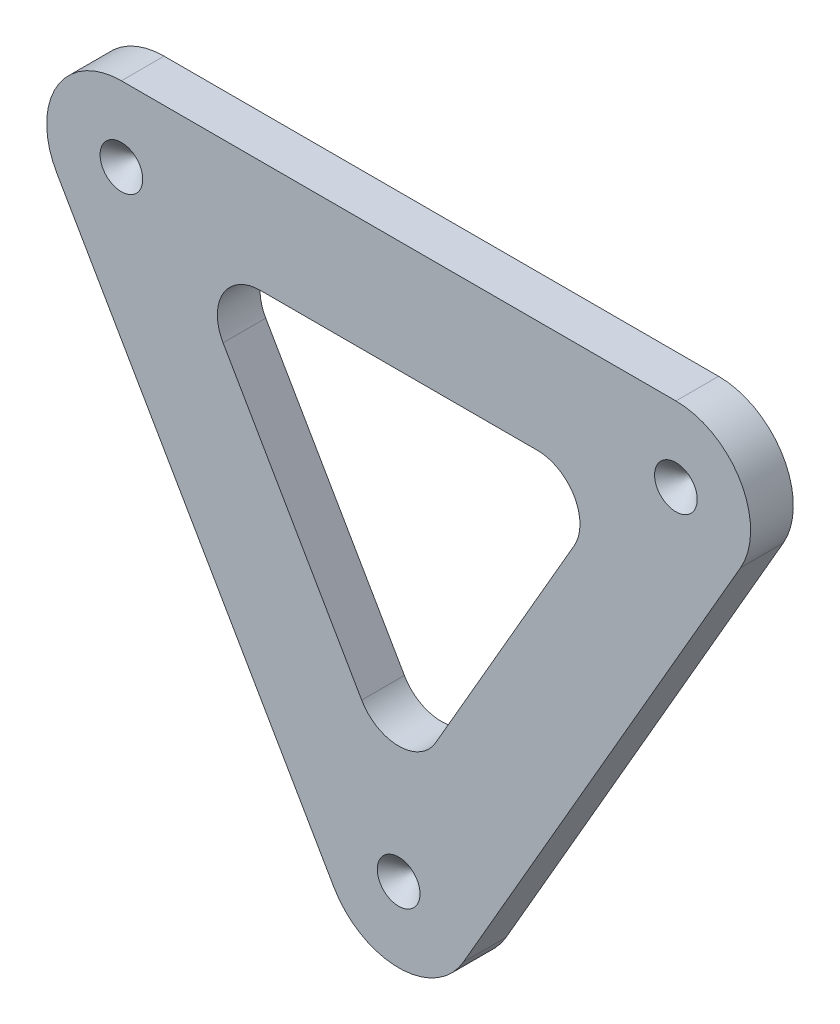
ISO-10303-21;
HEADER;
FILE_DESCRIPTION(('STEP AP214'),'2;1');
FILE_NAME('part.step','',(''),(''),'','','');
FILE_SCHEMA(('AUTOMOTIVE_DESIGN { 1 0 10303 214 1 1 1 1 }'));
ENDSEC;
DATA;
#1=APPLICATION_CONTEXT('core data for automotive mechanical design processes');
#2=APPLICATION_PROTOCOL_DEFINITION('international standard','automotive_design',2000,#1);
#3=PRODUCT_CONTEXT('',#1,'mechanical');
#4=PRODUCT('Part','Part','',(#3));
#5=PRODUCT_RELATED_PRODUCT_CATEGORY('part','',(#4));
#6=PRODUCT_DEFINITION_FORMATION('','',#4);
#7=PRODUCT_DEFINITION_CONTEXT('part definition',#1,'design');
#8=PRODUCT_DEFINITION('design','',#6,#7);
#9=PRODUCT_DEFINITION_SHAPE('','',#8);
#10=(LENGTH_UNIT() NAMED_UNIT(*) SI_UNIT(.MILLI.,.METRE.));
#11=(NAMED_UNIT(*) PLANE_ANGLE_UNIT() SI_UNIT($,.RADIAN.));
#12=(NAMED_UNIT(*) SI_UNIT($,.STERADIAN.) SOLID_ANGLE_UNIT());
#13=UNCERTAINTY_MEASURE_WITH_UNIT(LENGTH_MEASURE(1.E-05),#10,'distance_accuracy_value','');
#14=(GEOMETRIC_REPRESENTATION_CONTEXT(3) GLOBAL_UNCERTAINTY_ASSIGNED_CONTEXT((#13)) GLOBAL_UNIT_ASSIGNED_CONTEXT((#10,
#11,#12)) REPRESENTATION_CONTEXT('',''));
#15=CARTESIAN_POINT('',(0.,0.,0.));
#16=DIRECTION('',(0.,0.,1.));
#17=DIRECTION('',(1.,0.,0.));
#18=AXIS2_PLACEMENT_3D('',#15,#16,#17);
#19=CARTESIAN_POINT('',(12.9903810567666,7.5,2.));
#20=DIRECTION('',(0.,0.,1.));
#21=DIRECTION('',(1.,0.,0.));
#22=AXIS2_PLACEMENT_3D('',#19,#20,#21);
#23=PLANE('',#22);
#24=CARTESIAN_POINT('',(-12.9903810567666,7.49999999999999,2.));
#25=DIRECTION('',(0.,0.,1.));
#26=DIRECTION('',(1.,0.,0.));
#27=AXIS2_PLACEMENT_3D('',#24,#25,#26);
#28=CIRCLE('',#27,1.);
#29=CARTESIAN_POINT('',(-11.9903810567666,7.49999999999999,2.));
#30=VERTEX_POINT('',#29);
#31=EDGE_CURVE('E138',#30,#30,#28,.T.);
#32=ORIENTED_EDGE('',*,*,#31,.F.);
#33=EDGE_LOOP('',(#32));
#34=FACE_BOUND('',#33,.T.);
#35=CARTESIAN_POINT('',(0.,-15.,2.));
#36=DIRECTION('',(0.,0.,1.));
#37=DIRECTION('',(1.,0.,0.));
#38=AXIS2_PLACEMENT_3D('',#35,#36,#37);
#39=CIRCLE('',#38,1.);
#40=CARTESIAN_POINT('',(1.00000000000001,-15.,2.));
#41=VERTEX_POINT('',#40);
#42=EDGE_CURVE('E140',#41,#41,#39,.T.);
#43=ORIENTED_EDGE('',*,*,#42,.F.);
#44=EDGE_LOOP('',(#43));
#45=FACE_BOUND('',#44,.T.);
#46=CARTESIAN_POINT('',(12.9903810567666,7.5,2.));
#47=DIRECTION('',(0.,0.,1.));
#48=DIRECTION('',(1.,0.,0.));
#49=AXIS2_PLACEMENT_3D('',#46,#47,#48);
#50=CIRCLE('',#49,1.);
#51=CARTESIAN_POINT('',(13.9903810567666,7.5,2.));
#52=VERTEX_POINT('',#51);
#53=EDGE_CURVE('E143',#52,#52,#50,.T.);
#54=ORIENTED_EDGE('',*,*,#53,.F.);
#55=EDGE_LOOP('',(#54));
#56=FACE_BOUND('',#55,.T.);
#57=CARTESIAN_POINT('',(12.9903810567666,7.5,2.));
#58=DIRECTION('',(0.,0.,1.));
#59=DIRECTION('',(1.,0.,0.));
#60=AXIS2_PLACEMENT_3D('',#57,#58,#59);
#61=CIRCLE('',#60,3.50000000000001);
#62=CARTESIAN_POINT('',(16.0214699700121,5.75,2.));
#63=VERTEX_POINT('',#62);
#64=CARTESIAN_POINT('',(12.9903810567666,11.,2.));
#65=VERTEX_POINT('',#64);
#66=EDGE_CURVE('E166',#63,#65,#61,.T.);
#67=ORIENTED_EDGE('',*,*,#66,.T.);
#68=DIRECTION('',(-1.,0.,0.));
#69=VECTOR('',#68,1.);
#70=CARTESIAN_POINT('',(12.9903810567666,11.,2.));
#71=LINE('',#70,#69);
#72=CARTESIAN_POINT('',(-12.9903810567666,11.,2.));
#73=VERTEX_POINT('',#72);
#74=EDGE_CURVE('E169',#65,#73,#71,.T.);
#75=ORIENTED_EDGE('',*,*,#74,.T.);
#76=CARTESIAN_POINT('',(-12.9903810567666,7.49999999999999,2.));
#77=DIRECTION('',(0.,0.,1.));
#78=DIRECTION('',(1.,0.,0.));
#79=AXIS2_PLACEMENT_3D('',#76,#77,#78);
#80=CIRCLE('',#79,3.49999999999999);
#81=CARTESIAN_POINT('',(-16.0214699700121,5.74999999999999,2.));
#82=VERTEX_POINT('',#81);
#83=EDGE_CURVE('E172',#73,#82,#80,.T.);
#84=ORIENTED_EDGE('',*,*,#83,.T.);
#85=DIRECTION('',(0.5,-0.866025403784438,0.));
#86=VECTOR('',#85,1.);
#87=CARTESIAN_POINT('',(-16.0214699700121,5.74999999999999,2.));
#88=LINE('',#87,#86);
#89=CARTESIAN_POINT('',(-3.03108891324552,-16.75,2.));
#90=VERTEX_POINT('',#89);
#91=EDGE_CURVE('E174',#82,#90,#88,.T.);
#92=ORIENTED_EDGE('',*,*,#91,.T.);
#93=CARTESIAN_POINT('',(0.,-15.,2.));
#94=DIRECTION('',(0.,0.,1.));
#95=DIRECTION('',(1.,0.,0.));
#96=AXIS2_PLACEMENT_3D('',#93,#94,#95);
#97=CIRCLE('',#96,3.49999999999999);
#98=CARTESIAN_POINT('',(3.03108891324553,-16.75,2.));
#99=VERTEX_POINT('',#98);
#100=EDGE_CURVE('E176',#90,#99,#97,.T.);
#101=ORIENTED_EDGE('',*,*,#100,.T.);
#102=DIRECTION('',(0.5,0.866025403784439,0.));
#103=VECTOR('',#102,1.);
#104=CARTESIAN_POINT('',(3.03108891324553,-16.75,2.));
#105=LINE('',#104,#103);
#106=EDGE_CURVE('E178',#99,#63,#105,.T.);
#107=ORIENTED_EDGE('',*,*,#106,.T.);
#108=EDGE_LOOP('',(#67,#75,#84,#92,#101,#107));
#109=FACE_BOUND('',#108,.T.);
#110=DIRECTION('',(-1.,0.,0.));
#111=VECTOR('',#110,1.);
#112=CARTESIAN_POINT('',(9.95929214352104,5.75,2.));
#113=LINE('',#112,#111);
#114=CARTESIAN_POINT('',(6.49519052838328,5.75,2.));
#115=VERTEX_POINT('',#114);
#116=CARTESIAN_POINT('',(-6.49519052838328,5.75,2.));
#117=VERTEX_POINT('',#116);
#118=EDGE_CURVE('E151',#115,#117,#113,.T.);
#119=ORIENTED_EDGE('',*,*,#118,.F.);
#120=CARTESIAN_POINT('',(6.49519052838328,3.75,2.));
#121=DIRECTION('',(0.,0.,1.));
#122=DIRECTION('',(1.,0.,0.));
#123=AXIS2_PLACEMENT_3D('',#120,#121,#122);
#124=CIRCLE('',#123,2.);
#125=CARTESIAN_POINT('',(8.22724133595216,2.75,2.));
#126=VERTEX_POINT('',#125);
#127=EDGE_CURVE('E11',#115,#126,#124,.F.);
#128=ORIENTED_EDGE('',*,*,#127,.T.);
#129=DIRECTION('',(0.5,0.866025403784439,0.));
#130=VECTOR('',#129,1.);
#131=CARTESIAN_POINT('',(0.,-11.5,2.));
#132=LINE('',#131,#130);
#133=CARTESIAN_POINT('',(1.73205080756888,-8.49999999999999,2.));
#134=VERTEX_POINT('',#133);
#135=EDGE_CURVE('E149',#134,#126,#132,.T.);
#136=ORIENTED_EDGE('',*,*,#135,.F.);
#137=CARTESIAN_POINT('',(0.,-7.49999999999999,2.));
#138=DIRECTION('',(0.,0.,1.));
#139=DIRECTION('',(1.,0.,0.));
#140=AXIS2_PLACEMENT_3D('',#137,#138,#139);
#141=CIRCLE('',#140,2.);
#142=CARTESIAN_POINT('',(-1.73205080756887,-8.49999999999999,2.));
#143=VERTEX_POINT('',#142);
#144=EDGE_CURVE('E229',#134,#143,#141,.F.);
#145=ORIENTED_EDGE('',*,*,#144,.T.);
#146=DIRECTION('',(0.5,-0.866025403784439,0.));
#147=VECTOR('',#146,1.);
#148=CARTESIAN_POINT('',(-9.95929214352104,5.75,2.));
#149=LINE('',#148,#147);
#150=CARTESIAN_POINT('',(-8.22724133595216,2.75,2.));
#151=VERTEX_POINT('',#150);
#152=EDGE_CURVE('E155',#151,#143,#149,.T.);
#153=ORIENTED_EDGE('',*,*,#152,.F.);
#154=CARTESIAN_POINT('',(-6.49519052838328,3.75,2.));
#155=DIRECTION('',(0.,0.,1.));
#156=DIRECTION('',(1.,0.,0.));
#157=AXIS2_PLACEMENT_3D('',#154,#155,#156);
#158=CIRCLE('',#157,2.);
#159=EDGE_CURVE('E225',#151,#117,#158,.F.);
#160=ORIENTED_EDGE('',*,*,#159,.T.);
#161=EDGE_LOOP('',(#119,#128,#136,#145,#153,#160));
#162=FACE_BOUND('',#161,.T.);
#163=ADVANCED_FACE('F35',(#34,#45,#56,#109,#162),#23,.T.);
#164=CARTESIAN_POINT('',(12.9903810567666,7.5,0.));
#165=DIRECTION('',(0.,0.,1.));
#166=DIRECTION('',(1.,0.,0.));
#167=AXIS2_PLACEMENT_3D('',#164,#165,#166);
#168=PLANE('',#167);
#169=CARTESIAN_POINT('',(12.9903810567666,7.5,0.));
#170=DIRECTION('',(0.,0.,1.));
#171=DIRECTION('',(1.,0.,0.));
#172=AXIS2_PLACEMENT_3D('',#169,#170,#171);
#173=CIRCLE('',#172,3.50000000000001);
#174=CARTESIAN_POINT('',(16.0214699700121,5.75,0.));
#175=VERTEX_POINT('',#174);
#176=CARTESIAN_POINT('',(12.9903810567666,11.,0.));
#177=VERTEX_POINT('',#176);
#178=EDGE_CURVE('E158',#175,#177,#173,.T.);
#179=ORIENTED_EDGE('',*,*,#178,.F.);
#180=DIRECTION('',(0.5,0.866025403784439,0.));
#181=VECTOR('',#180,1.);
#182=CARTESIAN_POINT('',(3.03108891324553,-16.75,0.));
#183=LINE('',#182,#181);
#184=CARTESIAN_POINT('',(3.03108891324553,-16.75,0.));
#185=VERTEX_POINT('',#184);
#186=EDGE_CURVE('E170',#185,#175,#183,.T.);
#187=ORIENTED_EDGE('',*,*,#186,.F.);
#188=CARTESIAN_POINT('',(0.,-15.,0.));
#189=DIRECTION('',(0.,0.,1.));
#190=DIRECTION('',(1.,0.,0.));
#191=AXIS2_PLACEMENT_3D('',#188,#189,#190);
#192=CIRCLE('',#191,3.49999999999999);
#193=CARTESIAN_POINT('',(-3.03108891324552,-16.75,0.));
#194=VERTEX_POINT('',#193);
#195=EDGE_CURVE('E189',#194,#185,#192,.T.);
#196=ORIENTED_EDGE('',*,*,#195,.F.);
#197=DIRECTION('',(0.5,-0.866025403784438,0.));
#198=VECTOR('',#197,1.);
#199=CARTESIAN_POINT('',(-16.0214699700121,5.74999999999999,0.));
#200=LINE('',#199,#198);
#201=CARTESIAN_POINT('',(-16.0214699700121,5.74999999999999,0.));
#202=VERTEX_POINT('',#201);
#203=EDGE_CURVE('E187',#202,#194,#200,.T.);
#204=ORIENTED_EDGE('',*,*,#203,.F.);
#205=CARTESIAN_POINT('',(-12.9903810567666,7.49999999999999,0.));
#206=DIRECTION('',(0.,0.,1.));
#207=DIRECTION('',(1.,0.,0.));
#208=AXIS2_PLACEMENT_3D('',#205,#206,#207);
#209=CIRCLE('',#208,3.49999999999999);
#210=CARTESIAN_POINT('',(-12.9903810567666,11.,0.));
#211=VERTEX_POINT('',#210);
#212=EDGE_CURVE('E185',#211,#202,#209,.T.);
#213=ORIENTED_EDGE('',*,*,#212,.F.);
#214=DIRECTION('',(-1.,0.,0.));
#215=VECTOR('',#214,1.);
#216=CARTESIAN_POINT('',(12.9903810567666,11.,0.));
#217=LINE('',#216,#215);
#218=EDGE_CURVE('E183',#177,#211,#217,.T.);
#219=ORIENTED_EDGE('',*,*,#218,.F.);
#220=EDGE_LOOP('',(#179,#187,#196,#204,#213,#219));
#221=FACE_BOUND('',#220,.T.);
#222=DIRECTION('',(0.5,-0.866025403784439,0.));
#223=VECTOR('',#222,1.);
#224=CARTESIAN_POINT('',(-9.95929214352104,5.75,0.));
#225=LINE('',#224,#223);
#226=CARTESIAN_POINT('',(-8.22724133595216,2.75,0.));
#227=VERTEX_POINT('',#226);
#228=CARTESIAN_POINT('',(-1.73205080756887,-8.49999999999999,0.));
#229=VERTEX_POINT('',#228);
#230=EDGE_CURVE('E152',#227,#229,#225,.T.);
#231=ORIENTED_EDGE('',*,*,#230,.T.);
#232=CARTESIAN_POINT('',(0.,-7.49999999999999,0.));
#233=DIRECTION('',(0.,0.,1.));
#234=DIRECTION('',(1.,0.,0.));
#235=AXIS2_PLACEMENT_3D('',#232,#233,#234);
#236=CIRCLE('',#235,2.);
#237=CARTESIAN_POINT('',(1.73205080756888,-8.49999999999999,0.));
#238=VERTEX_POINT('',#237);
#239=EDGE_CURVE('E227',#229,#238,#236,.T.);
#240=ORIENTED_EDGE('',*,*,#239,.T.);
#241=DIRECTION('',(0.5,0.866025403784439,0.));
#242=VECTOR('',#241,1.);
#243=CARTESIAN_POINT('',(0.,-11.5,0.));
#244=LINE('',#243,#242);
#245=CARTESIAN_POINT('',(8.22724133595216,2.75,0.));
#246=VERTEX_POINT('',#245);
#247=EDGE_CURVE('E148',#238,#246,#244,.T.);
#248=ORIENTED_EDGE('',*,*,#247,.T.);
#249=CARTESIAN_POINT('',(6.49519052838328,3.75,0.));
#250=DIRECTION('',(0.,0.,1.));
#251=DIRECTION('',(1.,0.,0.));
#252=AXIS2_PLACEMENT_3D('',#249,#250,#251);
#253=CIRCLE('',#252,2.);
#254=CARTESIAN_POINT('',(6.49519052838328,5.75,0.));
#255=VERTEX_POINT('',#254);
#256=EDGE_CURVE('E43',#246,#255,#253,.T.);
#257=ORIENTED_EDGE('',*,*,#256,.T.);
#258=DIRECTION('',(-1.,0.,0.));
#259=VECTOR('',#258,1.);
#260=CARTESIAN_POINT('',(9.95929214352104,5.75,0.));
#261=LINE('',#260,#259);
#262=CARTESIAN_POINT('',(-6.49519052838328,5.75,0.));
#263=VERTEX_POINT('',#262);
#264=EDGE_CURVE('E161',#255,#263,#261,.T.);
#265=ORIENTED_EDGE('',*,*,#264,.T.);
#266=CARTESIAN_POINT('',(-6.49519052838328,3.75,0.));
#267=DIRECTION('',(0.,0.,1.));
#268=DIRECTION('',(1.,0.,0.));
#269=AXIS2_PLACEMENT_3D('',#266,#267,#268);
#270=CIRCLE('',#269,2.);
#271=EDGE_CURVE('E223',#263,#227,#270,.T.);
#272=ORIENTED_EDGE('',*,*,#271,.T.);
#273=EDGE_LOOP('',(#231,#240,#248,#257,#265,#272));
#274=FACE_BOUND('',#273,.T.);
#275=ADVANCED_FACE('F232',(#221,#274),#168,.F.);
#276=CARTESIAN_POINT('',(12.9903810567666,7.5,2.));
#277=DIRECTION('',(0.,0.,-1.));
#278=DIRECTION('',(-1.,0.,0.));
#279=AXIS2_PLACEMENT_3D('',#276,#277,#278);
#280=CYLINDRICAL_SURFACE('',#279,3.50000000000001);
#281=ORIENTED_EDGE('',*,*,#178,.T.);
#282=DIRECTION('',(0.,0.,-1.));
#283=VECTOR('',#282,1.);
#284=CARTESIAN_POINT('',(12.9903810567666,11.,2.));
#285=LINE('',#284,#283);
#286=EDGE_CURVE('E206',#65,#177,#285,.T.);
#287=ORIENTED_EDGE('',*,*,#286,.F.);
#288=ORIENTED_EDGE('',*,*,#66,.F.);
#289=DIRECTION('',(0.,0.,-1.));
#290=VECTOR('',#289,1.);
#291=CARTESIAN_POINT('',(16.0214699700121,5.75,2.));
#292=LINE('',#291,#290);
#293=EDGE_CURVE('E180',#63,#175,#292,.T.);
#294=ORIENTED_EDGE('',*,*,#293,.T.);
#295=EDGE_LOOP('',(#281,#287,#288,#294));
#296=FACE_BOUND('',#295,.T.);
#297=ADVANCED_FACE('F265',(#296),#280,.T.);
#298=CARTESIAN_POINT('',(12.9903810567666,11.,2.));
#299=DIRECTION('',(0.,-1.,0.));
#300=DIRECTION('',(1.,0.,0.));
#301=AXIS2_PLACEMENT_3D('',#298,#299,#300);
#302=PLANE('',#301);
#303=ORIENTED_EDGE('',*,*,#218,.T.);
#304=DIRECTION('',(0.,0.,-1.));
#305=VECTOR('',#304,1.);
#306=CARTESIAN_POINT('',(-12.9903810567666,11.,2.));
#307=LINE('',#306,#305);
#308=EDGE_CURVE('E203',#73,#211,#307,.T.);
#309=ORIENTED_EDGE('',*,*,#308,.F.);
#310=ORIENTED_EDGE('',*,*,#74,.F.);
#311=ORIENTED_EDGE('',*,*,#286,.T.);
#312=EDGE_LOOP('',(#303,#309,#310,#311));
#313=FACE_BOUND('',#312,.T.);
#314=ADVANCED_FACE('F287',(#313),#302,.F.);
#315=CARTESIAN_POINT('',(-12.9903810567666,7.49999999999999,2.));
#316=DIRECTION('',(0.,0.,-1.));
#317=DIRECTION('',(-1.,0.,0.));
#318=AXIS2_PLACEMENT_3D('',#315,#316,#317);
#319=CYLINDRICAL_SURFACE('',#318,3.49999999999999);
#320=ORIENTED_EDGE('',*,*,#212,.T.);
#321=DIRECTION('',(0.,0.,-1.));
#322=VECTOR('',#321,1.);
#323=CARTESIAN_POINT('',(-16.0214699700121,5.74999999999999,2.));
#324=LINE('',#323,#322);
#325=EDGE_CURVE('E200',#82,#202,#324,.T.);
#326=ORIENTED_EDGE('',*,*,#325,.F.);
#327=ORIENTED_EDGE('',*,*,#83,.F.);
#328=ORIENTED_EDGE('',*,*,#308,.T.);
#329=EDGE_LOOP('',(#320,#326,#327,#328));
#330=FACE_BOUND('',#329,.T.);
#331=ADVANCED_FACE('F283',(#330),#319,.T.);
#332=CARTESIAN_POINT('',(-16.0214699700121,5.74999999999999,2.));
#333=DIRECTION('',(0.866025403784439,0.5,0.));
#334=DIRECTION('',(-0.5,0.866025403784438,0.));
#335=AXIS2_PLACEMENT_3D('',#332,#333,#334);
#336=PLANE('',#335);
#337=ORIENTED_EDGE('',*,*,#203,.T.);
#338=DIRECTION('',(0.,0.,-1.));
#339=VECTOR('',#338,1.);
#340=CARTESIAN_POINT('',(-3.03108891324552,-16.75,2.));
#341=LINE('',#340,#339);
#342=EDGE_CURVE('E197',#90,#194,#341,.T.);
#343=ORIENTED_EDGE('',*,*,#342,.F.);
#344=ORIENTED_EDGE('',*,*,#91,.F.);
#345=ORIENTED_EDGE('',*,*,#325,.T.);
#346=EDGE_LOOP('',(#337,#343,#344,#345));
#347=FACE_BOUND('',#346,.T.);
#348=ADVANCED_FACE('F279',(#347),#336,.F.);
#349=CARTESIAN_POINT('',(0.,-15.,2.));
#350=DIRECTION('',(0.,0.,-1.));
#351=DIRECTION('',(-1.,0.,0.));
#352=AXIS2_PLACEMENT_3D('',#349,#350,#351);
#353=CYLINDRICAL_SURFACE('',#352,3.49999999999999);
#354=ORIENTED_EDGE('',*,*,#195,.T.);
#355=DIRECTION('',(0.,0.,-1.));
#356=VECTOR('',#355,1.);
#357=CARTESIAN_POINT('',(3.03108891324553,-16.75,2.));
#358=LINE('',#357,#356);
#359=EDGE_CURVE('E194',#99,#185,#358,.T.);
#360=ORIENTED_EDGE('',*,*,#359,.F.);
#361=ORIENTED_EDGE('',*,*,#100,.F.);
#362=ORIENTED_EDGE('',*,*,#342,.T.);
#363=EDGE_LOOP('',(#354,#360,#361,#362));
#364=FACE_BOUND('',#363,.T.);
#365=ADVANCED_FACE('F275',(#364),#353,.T.);
#366=CARTESIAN_POINT('',(3.03108891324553,-16.75,2.));
#367=DIRECTION('',(-0.866025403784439,0.5,0.));
#368=DIRECTION('',(-0.5,-0.866025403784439,0.));
#369=AXIS2_PLACEMENT_3D('',#366,#367,#368);
#370=PLANE('',#369);
#371=ORIENTED_EDGE('',*,*,#186,.T.);
#372=ORIENTED_EDGE('',*,*,#293,.F.);
#373=ORIENTED_EDGE('',*,*,#106,.F.);
#374=ORIENTED_EDGE('',*,*,#359,.T.);
#375=EDGE_LOOP('',(#371,#372,#373,#374));
#376=FACE_BOUND('',#375,.T.);
#377=ADVANCED_FACE('F272',(#376),#370,.F.);
#378=CARTESIAN_POINT('',(0.,-11.5,2.));
#379=DIRECTION('',(-0.866025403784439,0.5,0.));
#380=DIRECTION('',(-0.5,-0.866025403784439,0.));
#381=AXIS2_PLACEMENT_3D('',#378,#379,#380);
#382=PLANE('',#381);
#383=ORIENTED_EDGE('',*,*,#247,.F.);
#384=DIRECTION('',(0.,0.,-1.));
#385=VECTOR('',#384,1.);
#386=CARTESIAN_POINT('',(1.73205080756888,-8.49999999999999,2.));
#387=LINE('',#386,#385);
#388=EDGE_CURVE('E55',#238,#134,#387,.F.);
#389=ORIENTED_EDGE('',*,*,#388,.T.);
#390=ORIENTED_EDGE('',*,*,#135,.T.);
#391=DIRECTION('',(0.,0.,-1.));
#392=VECTOR('',#391,1.);
#393=CARTESIAN_POINT('',(8.22724133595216,2.75,0.));
#394=LINE('',#393,#392);
#395=EDGE_CURVE('E219',#126,#246,#394,.T.);
#396=ORIENTED_EDGE('',*,*,#395,.T.);
#397=EDGE_LOOP('',(#383,#389,#390,#396));
#398=FACE_BOUND('',#397,.T.);
#399=ADVANCED_FACE('F239',(#398),#382,.T.);
#400=CARTESIAN_POINT('',(9.95929214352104,5.75,2.));
#401=DIRECTION('',(0.,-1.,0.));
#402=DIRECTION('',(1.,0.,0.));
#403=AXIS2_PLACEMENT_3D('',#400,#401,#402);
#404=PLANE('',#403);
#405=ORIENTED_EDGE('',*,*,#118,.T.);
#406=DIRECTION('',(0.,0.,-1.));
#407=VECTOR('',#406,1.);
#408=CARTESIAN_POINT('',(-6.49519052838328,5.75,0.));
#409=LINE('',#408,#407);
#410=EDGE_CURVE('E211',#117,#263,#409,.T.);
#411=ORIENTED_EDGE('',*,*,#410,.T.);
#412=ORIENTED_EDGE('',*,*,#264,.F.);
#413=DIRECTION('',(0.,0.,-1.));
#414=VECTOR('',#413,1.);
#415=CARTESIAN_POINT('',(6.49519052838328,5.75,2.));
#416=LINE('',#415,#414);
#417=EDGE_CURVE('E209',#255,#115,#416,.F.);
#418=ORIENTED_EDGE('',*,*,#417,.T.);
#419=EDGE_LOOP('',(#405,#411,#412,#418));
#420=FACE_BOUND('',#419,.T.);
#421=ADVANCED_FACE('F237',(#420),#404,.T.);
#422=CARTESIAN_POINT('',(-9.95929214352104,5.75,2.));
#423=DIRECTION('',(0.866025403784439,0.5,0.));
#424=DIRECTION('',(-0.5,0.866025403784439,0.));
#425=AXIS2_PLACEMENT_3D('',#422,#423,#424);
#426=PLANE('',#425);
#427=ORIENTED_EDGE('',*,*,#230,.F.);
#428=DIRECTION('',(0.,0.,-1.));
#429=VECTOR('',#428,1.);
#430=CARTESIAN_POINT('',(-8.22724133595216,2.75,2.));
#431=LINE('',#430,#429);
#432=EDGE_CURVE('E217',#227,#151,#431,.F.);
#433=ORIENTED_EDGE('',*,*,#432,.T.);
#434=ORIENTED_EDGE('',*,*,#152,.T.);
#435=DIRECTION('',(0.,0.,-1.));
#436=VECTOR('',#435,1.);
#437=CARTESIAN_POINT('',(-1.73205080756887,-8.49999999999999,0.));
#438=LINE('',#437,#436);
#439=EDGE_CURVE('E214',#143,#229,#438,.T.);
#440=ORIENTED_EDGE('',*,*,#439,.T.);
#441=EDGE_LOOP('',(#427,#433,#434,#440));
#442=FACE_BOUND('',#441,.T.);
#443=ADVANCED_FACE('F247',(#442),#426,.T.);
#444=CARTESIAN_POINT('',(-6.49519052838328,3.75,2.));
#445=DIRECTION('',(0.,0.,1.));
#446=DIRECTION('',(1.,0.,0.));
#447=AXIS2_PLACEMENT_3D('',#444,#445,#446);
#448=CYLINDRICAL_SURFACE('',#447,2.);
#449=ORIENTED_EDGE('',*,*,#159,.F.);
#450=ORIENTED_EDGE('',*,*,#432,.F.);
#451=ORIENTED_EDGE('',*,*,#271,.F.);
#452=ORIENTED_EDGE('',*,*,#410,.F.);
#453=EDGE_LOOP('',(#449,#450,#451,#452));
#454=FACE_BOUND('',#453,.T.);
#455=ADVANCED_FACE('F251',(#454),#448,.F.);
#456=CARTESIAN_POINT('',(0.,-7.49999999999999,2.));
#457=DIRECTION('',(0.,0.,1.));
#458=DIRECTION('',(1.,0.,0.));
#459=AXIS2_PLACEMENT_3D('',#456,#457,#458);
#460=CYLINDRICAL_SURFACE('',#459,2.);
#461=ORIENTED_EDGE('',*,*,#144,.F.);
#462=ORIENTED_EDGE('',*,*,#388,.F.);
#463=ORIENTED_EDGE('',*,*,#239,.F.);
#464=ORIENTED_EDGE('',*,*,#439,.F.);
#465=EDGE_LOOP('',(#461,#462,#463,#464));
#466=FACE_BOUND('',#465,.T.);
#467=ADVANCED_FACE('F244',(#466),#460,.F.);
#468=CARTESIAN_POINT('',(6.49519052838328,3.75,2.));
#469=DIRECTION('',(0.,0.,1.));
#470=DIRECTION('',(1.,0.,0.));
#471=AXIS2_PLACEMENT_3D('',#468,#469,#470);
#472=CYLINDRICAL_SURFACE('',#471,2.);
#473=ORIENTED_EDGE('',*,*,#127,.F.);
#474=ORIENTED_EDGE('',*,*,#417,.F.);
#475=ORIENTED_EDGE('',*,*,#256,.F.);
#476=ORIENTED_EDGE('',*,*,#395,.F.);
#477=EDGE_LOOP('',(#473,#474,#475,#476));
#478=FACE_BOUND('',#477,.T.);
#479=ADVANCED_FACE('F37',(#478),#472,.F.);
#480=CARTESIAN_POINT('',(12.9903810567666,7.5,2.));
#481=DIRECTION('',(0.,0.,1.));
#482=DIRECTION('',(1.,0.,0.));
#483=AXIS2_PLACEMENT_3D('',#480,#481,#482);
#484=CONICAL_SURFACE('',#483,1.,0.78539816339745);
#485=CARTESIAN_POINT('',(12.9903810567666,7.5,1.));
#486=VERTEX_POINT('',#485);
#487=VERTEX_LOOP('',#486);
#488=FACE_BOUND('',#487,.T.);
#489=ORIENTED_EDGE('',*,*,#53,.T.);
#490=EDGE_LOOP('',(#489));
#491=FACE_BOUND('',#490,.T.);
#492=ADVANCED_FACE('F366',(#488,#491),#484,.F.);
#493=CARTESIAN_POINT('',(0.,-15.,2.));
#494=DIRECTION('',(0.,0.,1.));
#495=DIRECTION('',(1.,0.,0.));
#496=AXIS2_PLACEMENT_3D('',#493,#494,#495);
#497=CONICAL_SURFACE('',#496,1.,0.78539816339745);
#498=CARTESIAN_POINT('',(0.,-15.,1.));
#499=VERTEX_POINT('',#498);
#500=VERTEX_LOOP('',#499);
#501=FACE_BOUND('',#500,.T.);
#502=ORIENTED_EDGE('',*,*,#42,.T.);
#503=EDGE_LOOP('',(#502));
#504=FACE_BOUND('',#503,.T.);
#505=ADVANCED_FACE('F134',(#501,#504),#497,.F.);
#506=CARTESIAN_POINT('',(-12.9903810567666,7.49999999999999,2.));
#507=DIRECTION('',(0.,0.,1.));
#508=DIRECTION('',(1.,0.,0.));
#509=AXIS2_PLACEMENT_3D('',#506,#507,#508);
#510=CONICAL_SURFACE('',#509,1.,0.78539816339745);
#511=CARTESIAN_POINT('',(-12.9903810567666,7.49999999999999,1.));
#512=VERTEX_POINT('',#511);
#513=VERTEX_LOOP('',#512);
#514=FACE_BOUND('',#513,.T.);
#515=ORIENTED_EDGE('',*,*,#31,.T.);
#516=EDGE_LOOP('',(#515));
#517=FACE_BOUND('',#516,.T.);
#518=ADVANCED_FACE('F131',(#514,#517),#510,.F.);
#519=CLOSED_SHELL('',(#163,#275,#297,#314,#331,#348,#365,#377,#399,#421,#443,#455,#467,#479,
#492,#505,#518));
#520=MANIFOLD_SOLID_BREP('B2',#519);
#521=ADVANCED_BREP_SHAPE_REPRESENTATION('',(#18,#520),#14);
#522=SHAPE_DEFINITION_REPRESENTATION(#9,#521);
ENDSEC;
END-ISO-10303-21;
